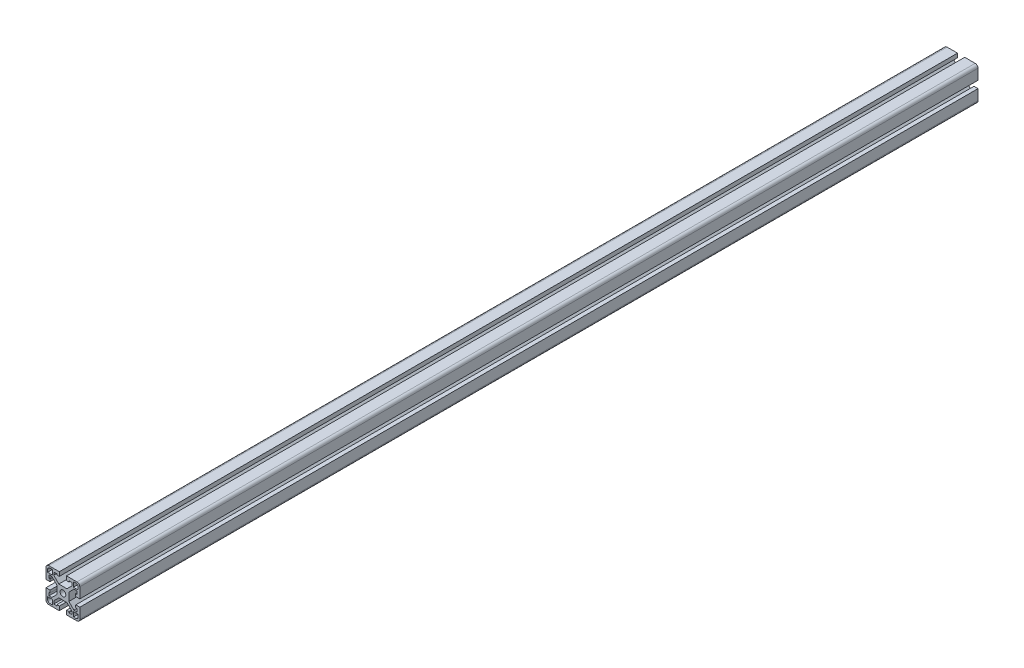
from build123d import *

# Parameters (mm, degrees)
SKETCH1_R           = 3.2639
BOSS_EXTRUDE1_DEPTH = 1012.825


with BuildPart() as part:
    # Sketch1 → Boss-Extrude1 (new body)
    with BuildSketch(Plane.XY):
        with BuildLine():
            Line((-6.731, 4.575738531), (-6.731, -4.575738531))
            Line((-6.731, -4.575738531), (-12.442261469, -10.287))
            Line((-12.442261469, -10.287), (-15.6718, -10.287))
            Line((-15.6718, -10.287), (-15.6718, -6.858))
            Line((-15.6718, -6.858), (-14.478, -6.858))
            Line((-14.478, -6.858), (-14.478, -4.064))
            Line((-14.478, -4.064), (-19.05, -4.064))
            Line((-19.05, -4.064), (-19.05, -15.875))
            ThreePointArc((-19.05, -15.875), (-18.12006403, -18.12006403), (-15.875, -19.05))
            Line((-15.875, -19.05), (-4.064, -19.05))
            Line((-4.064, -19.05), (-4.064, -14.478))
            Line((-4.064, -14.478), (-6.858, -14.478))
            Line((-6.858, -14.478), (-6.858, -15.6718))
            Line((-6.858, -15.6718), (-10.287, -15.6718))
            Line((-10.287, -15.6718), (-10.287, -12.442261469))
            Line((-10.287, -12.442261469), (-4.575738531, -6.731))
            Line((-4.575738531, -6.731), (4.575738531, -6.731))
            Line((4.575738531, -6.731), (10.287, -12.442261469))
            Line((10.287, -12.442261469), (10.287, -15.6718))
            Line((10.287, -15.6718), (6.858, -15.6718))
            Line((6.858, -15.6718), (6.858, -14.478))
            Line((6.858, -14.478), (4.064, -14.478))
            Line((4.064, -14.478), (4.064, -19.05))
            Line((4.064, -19.05), (15.875, -19.05))
            ThreePointArc((15.875, -19.05), (18.12006403, -18.12006403), (19.05, -15.875))
            Line((19.05, -15.875), (19.05, -4.064))
            Line((19.05, -4.064), (14.478, -4.064))
            Line((14.478, -4.064), (14.478, -6.858))
            Line((14.478, -6.858), (15.6718, -6.858))
            Line((15.6718, -6.858), (15.6718, -10.287))
            Line((15.6718, -10.287), (12.442261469, -10.287))
            Line((12.442261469, -10.287), (6.731, -4.575738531))
            Line((6.731, -4.575738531), (6.731, 4.575738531))
            Line((6.731, 4.575738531), (12.442261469, 10.287))
            Line((12.442261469, 10.287), (15.6718, 10.287))
            Line((15.6718, 10.287), (15.6718, 6.858))
            Line((15.6718, 6.858), (14.478, 6.858))
            Line((14.478, 6.858), (14.478, 4.064))
            Line((14.478, 4.064), (19.05, 4.064))
            Line((19.05, 4.064), (19.05, 15.875))
            ThreePointArc((19.05, 15.875), (18.12006403, 18.12006403), (15.875, 19.05))
            Line((15.875, 19.05), (4.064, 19.05))
            Line((4.064, 19.05), (4.064, 14.478))
            Line((4.064, 14.478), (6.858, 14.478))
            Line((6.858, 14.478), (6.858, 15.6718))
            Line((6.858, 15.6718), (10.287, 15.6718))
            Line((10.287, 15.6718), (10.287, 12.442261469))
            Line((10.287, 12.442261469), (4.575738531, 6.731))
            Line((4.575738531, 6.731), (-4.575738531, 6.731))
            Line((-4.575738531, 6.731), (-10.287, 12.442261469))
            Line((-10.287, 12.442261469), (-10.287, 15.6718))
            Line((-10.287, 15.6718), (-6.858, 15.6718))
            Line((-6.858, 15.6718), (-6.858, 14.478))
            Line((-6.858, 14.478), (-4.064, 14.478))
            Line((-4.064, 14.478), (-4.064, 19.05))
            Line((-4.064, 19.05), (-15.875, 19.05))
            ThreePointArc((-15.875, 19.05), (-18.12006403, 18.12006403), (-19.05, 15.875))
            Line((-19.05, 15.875), (-19.05, 4.064))
            Line((-19.05, 4.064), (-14.478, 4.064))
            Line((-14.478, 4.064), (-14.478, 6.858))
            Line((-14.478, 6.858), (-15.6718, 6.858))
            Line((-15.6718, 6.858), (-15.6718, 10.287))
            Line((-15.6718, 10.287), (-12.442261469, 10.287))
            Line((-12.442261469, 10.287), (-6.731, 4.575738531))
        make_face()
        Circle(SKETCH1_R, mode=Mode.SUBTRACT)
        with BuildLine():
            Line((-11.8872, 17.272), (-14.478, 17.272))
            ThreePointArc((-14.478, 17.272), (-16.453656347, 16.453656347), (-17.272, 14.478))
            Line((-17.272, 14.478), (-17.272, 11.8872))
            Line((-17.272, 11.8872), (-11.8872, 11.8872))
            Line((-11.8872, 11.8872), (-11.8872, 17.272))
        make_face(mode=Mode.SUBTRACT)
        with BuildLine():
            Line((14.478, 17.272), (11.8872, 17.272))
            Line((11.8872, 17.272), (11.8872, 11.8872))
            Line((11.8872, 11.8872), (17.272, 11.8872))
            Line((17.272, 11.8872), (17.272, 14.478))
            ThreePointArc((17.272, 14.478), (16.453656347, 16.453656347), (14.478, 17.272))
        make_face(mode=Mode.SUBTRACT)
        with BuildLine():
            Line((11.8872, -17.272), (14.478, -17.272))
            ThreePointArc((14.478, -17.272), (16.453656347, -16.453656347), (17.272, -14.478))
            Line((17.272, -14.478), (17.272, -11.8872))
            Line((17.272, -11.8872), (11.8872, -11.8872))
            Line((11.8872, -11.8872), (11.8872, -17.272))
        make_face(mode=Mode.SUBTRACT)
        with BuildLine():
            Line((-14.478, -17.272), (-11.8872, -17.272))
            Line((-11.8872, -17.272), (-11.8872, -11.8872))
            Line((-11.8872, -11.8872), (-17.272, -11.8872))
            Line((-17.272, -11.8872), (-17.272, -14.478))
            ThreePointArc((-17.272, -14.478), (-16.453656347, -16.453656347), (-14.478, -17.272))
        make_face(mode=Mode.SUBTRACT)
    extrude(amount=-BOSS_EXTRUDE1_DEPTH)


solid = part.part
